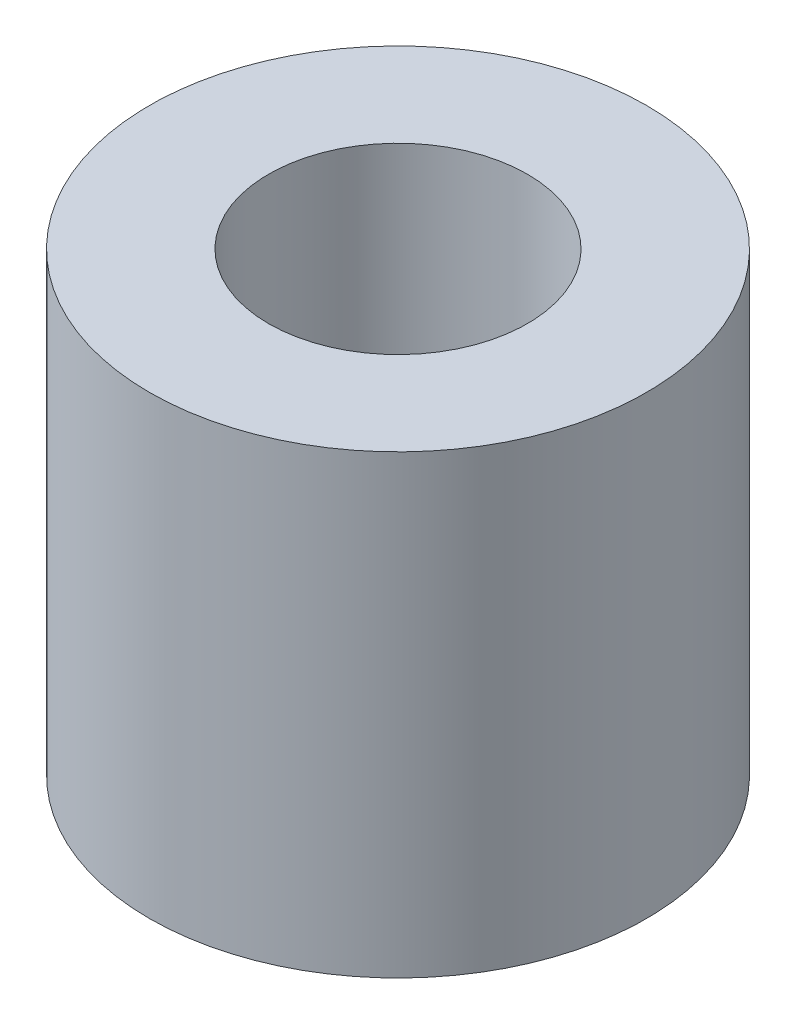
from build123d import *

# Parameters (mm, degrees)
SKETCH1_W = 1.4605
SKETCH1_H = 5.588


with BuildPart() as part:
    # Sketch1 → Revolve1 (revolve)
    with BuildSketch(Plane.XY, mode=Mode.PRIVATE) as revolve1_sk:
        with Locations((-2.31775, 2.794)):
            Rectangle(SKETCH1_W, SKETCH1_H)
    revolve(revolve1_sk.sketch.rotate(Axis((0, 0, 0), (0, 1, 0)), 270), axis=Axis((0, 0, 0), (0, 1, 0)))


solid = part.part
